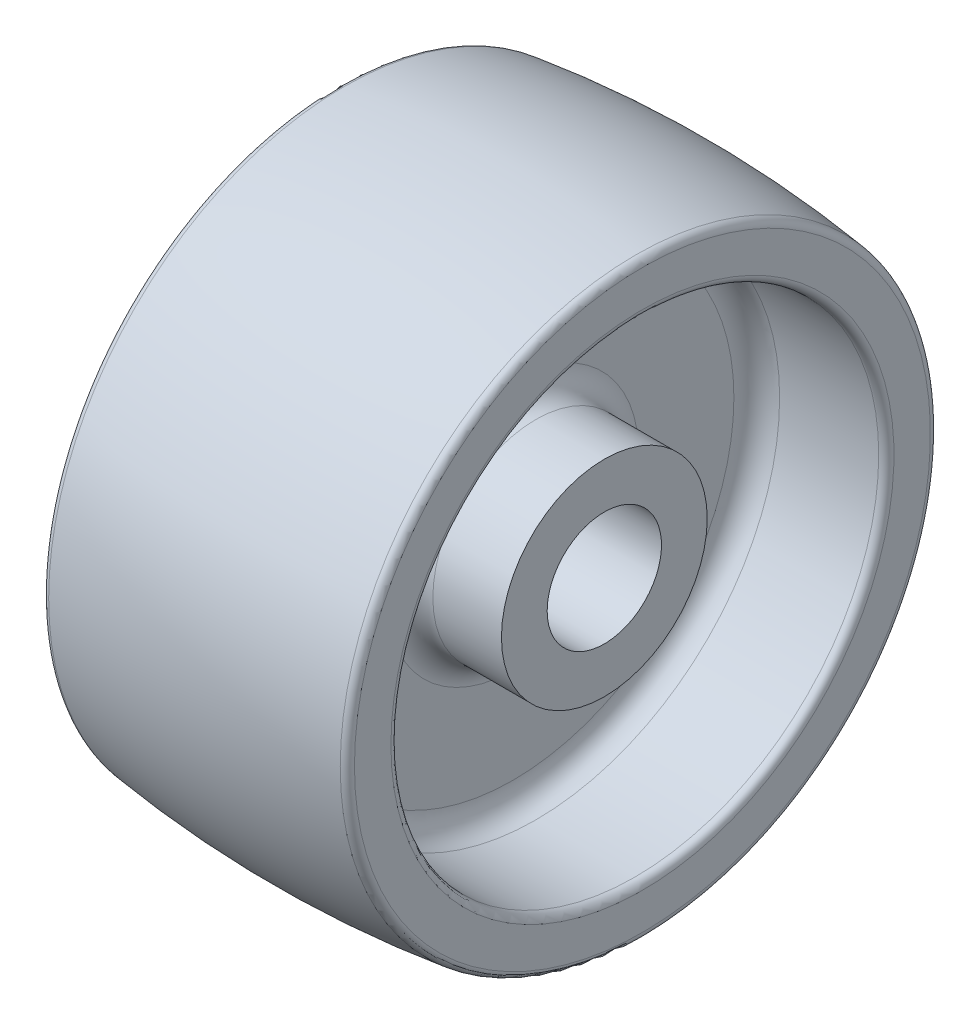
ISO-10303-21;
HEADER;
FILE_DESCRIPTION(('STEP AP214'),'2;1');
FILE_NAME('part.step','',(''),(''),'','','');
FILE_SCHEMA(('AUTOMOTIVE_DESIGN { 1 0 10303 214 1 1 1 1 }'));
ENDSEC;
DATA;
#1=APPLICATION_CONTEXT('core data for automotive mechanical design processes');
#2=APPLICATION_PROTOCOL_DEFINITION('international standard','automotive_design',2000,#1);
#3=PRODUCT_CONTEXT('',#1,'mechanical');
#4=PRODUCT('Part','Part','',(#3));
#5=PRODUCT_RELATED_PRODUCT_CATEGORY('part','',(#4));
#6=PRODUCT_DEFINITION_FORMATION('','',#4);
#7=PRODUCT_DEFINITION_CONTEXT('part definition',#1,'design');
#8=PRODUCT_DEFINITION('design','',#6,#7);
#9=PRODUCT_DEFINITION_SHAPE('','',#8);
#10=(LENGTH_UNIT() NAMED_UNIT(*) SI_UNIT(.MILLI.,.METRE.));
#11=(NAMED_UNIT(*) PLANE_ANGLE_UNIT() SI_UNIT($,.RADIAN.));
#12=(NAMED_UNIT(*) SI_UNIT($,.STERADIAN.) SOLID_ANGLE_UNIT());
#13=UNCERTAINTY_MEASURE_WITH_UNIT(LENGTH_MEASURE(1.E-05),#10,'distance_accuracy_value','');
#14=(GEOMETRIC_REPRESENTATION_CONTEXT(3) GLOBAL_UNCERTAINTY_ASSIGNED_CONTEXT((#13)) GLOBAL_UNIT_ASSIGNED_CONTEXT((#10,
#11,#12)) REPRESENTATION_CONTEXT('',''));
#15=CARTESIAN_POINT('',(0.,0.,0.));
#16=DIRECTION('',(0.,0.,1.));
#17=DIRECTION('',(1.,0.,0.));
#18=AXIS2_PLACEMENT_3D('',#15,#16,#17);
#19=CARTESIAN_POINT('',(40.,64.,0.));
#20=DIRECTION('',(-1.,0.,0.));
#21=DIRECTION('',(0.,0.,1.));
#22=AXIS2_PLACEMENT_3D('',#19,#20,#21);
#23=PLANE('',#22);
#24=CARTESIAN_POINT('',(40.0000000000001,0.,0.));
#25=DIRECTION('',(-1.,0.,0.));
#26=DIRECTION('',(0.,0.,1.));
#27=AXIS2_PLACEMENT_3D('',#24,#25,#26);
#28=CIRCLE('',#27,66.);
#29=CARTESIAN_POINT('',(40.0000000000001,0.,66.0000000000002));
#30=VERTEX_POINT('',#29);
#31=EDGE_CURVE('E59',#30,#30,#28,.T.);
#32=ORIENTED_EDGE('',*,*,#31,.T.);
#33=EDGE_LOOP('',(#32));
#34=FACE_BOUND('',#33,.T.);
#35=CARTESIAN_POINT('',(40.0000000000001,0.,0.));
#36=DIRECTION('',(-1.,0.,0.));
#37=DIRECTION('',(0.,0.,1.));
#38=AXIS2_PLACEMENT_3D('',#35,#36,#37);
#39=CIRCLE('',#38,75.5672512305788);
#40=CARTESIAN_POINT('',(40.0000000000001,0.,75.5672512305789));
#41=VERTEX_POINT('',#40);
#42=EDGE_CURVE('E62',#41,#41,#39,.F.);
#43=ORIENTED_EDGE('',*,*,#42,.T.);
#44=EDGE_LOOP('',(#43));
#45=FACE_BOUND('',#44,.T.);
#46=ADVANCED_FACE('F34',(#34,#45),#23,.F.);
#47=CARTESIAN_POINT('',(0.,0.,0.));
#48=DIRECTION('',(-1.,0.,0.));
#49=DIRECTION('',(0.,0.,1.));
#50=AXIS2_PLACEMENT_3D('',#47,#48,#49);
#51=DEGENERATE_TOROIDAL_SURFACE('',#50,220.,300.,.F.);
#52=CARTESIAN_POINT('',(38.2550335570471,0.,0.));
#53=DIRECTION('',(-1.,0.,0.));
#54=DIRECTION('',(0.,0.,1.));
#55=AXIS2_PLACEMENT_3D('',#52,#53,#54);
#56=CIRCLE('',#55,77.5509240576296);
#57=CARTESIAN_POINT('',(38.2550335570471,0.,77.5509240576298));
#58=VERTEX_POINT('',#57);
#59=EDGE_CURVE('E48',#58,#58,#56,.T.);
#60=ORIENTED_EDGE('',*,*,#59,.T.);
#61=EDGE_LOOP('',(#60));
#62=FACE_BOUND('',#61,.T.);
#63=CARTESIAN_POINT('',(-38.255033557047,-2.4980018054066E-13,0.));
#64=DIRECTION('',(1.,0.,0.));
#65=DIRECTION('',(0.,0.,-1.));
#66=AXIS2_PLACEMENT_3D('',#63,#64,#65);
#67=CIRCLE('',#66,77.5509240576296);
#68=CARTESIAN_POINT('',(-38.255033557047,-2.49783364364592E-13,-77.5509240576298));
#69=VERTEX_POINT('',#68);
#70=EDGE_CURVE('E53',#69,#69,#67,.T.);
#71=ORIENTED_EDGE('',*,*,#70,.T.);
#72=EDGE_LOOP('',(#71));
#73=FACE_BOUND('',#72,.T.);
#74=ADVANCED_FACE('F134',(#62,#73),#51,.F.);
#75=CARTESIAN_POINT('',(-40.,64.,0.));
#76=DIRECTION('',(1.,0.,0.));
#77=DIRECTION('',(0.,0.,-1.));
#78=AXIS2_PLACEMENT_3D('',#75,#76,#77);
#79=PLANE('',#78);
#80=CARTESIAN_POINT('',(-40.,-2.22044604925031E-13,0.));
#81=DIRECTION('',(1.,0.,0.));
#82=DIRECTION('',(0.,0.,-1.));
#83=AXIS2_PLACEMENT_3D('',#80,#81,#82);
#84=CIRCLE('',#83,66.);
#85=CARTESIAN_POINT('',(-40.,-2.22030293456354E-13,-66.0000000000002));
#86=VERTEX_POINT('',#85);
#87=EDGE_CURVE('E10',#86,#86,#84,.T.);
#88=ORIENTED_EDGE('',*,*,#87,.T.);
#89=EDGE_LOOP('',(#88));
#90=FACE_BOUND('',#89,.T.);
#91=CARTESIAN_POINT('',(-40.,-2.22044604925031E-13,0.));
#92=DIRECTION('',(1.,0.,0.));
#93=DIRECTION('',(0.,0.,-1.));
#94=AXIS2_PLACEMENT_3D('',#91,#92,#93);
#95=CIRCLE('',#94,75.5672512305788);
#96=CARTESIAN_POINT('',(-40.,-2.22028218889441E-13,-75.5672512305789));
#97=VERTEX_POINT('',#96);
#98=EDGE_CURVE('E40',#97,#97,#95,.F.);
#99=ORIENTED_EDGE('',*,*,#98,.T.);
#100=EDGE_LOOP('',(#99));
#101=FACE_BOUND('',#100,.T.);
#102=ADVANCED_FACE('F139',(#90,#101),#79,.F.);
#103=CARTESIAN_POINT('',(-44.4786429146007,-2.4980018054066E-13,0.));
#104=DIRECTION('',(-1.,0.,0.));
#105=DIRECTION('',(0.,0.,1.));
#106=AXIS2_PLACEMENT_3D('',#103,#104,#105);
#107=CYLINDRICAL_SURFACE('',#106,64.);
#108=CARTESIAN_POINT('',(-38.,-2.4980018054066E-13,0.));
#109=DIRECTION('',(1.,0.,0.));
#110=DIRECTION('',(0.,0.,-1.));
#111=AXIS2_PLACEMENT_3D('',#108,#109,#110);
#112=CIRCLE('',#111,64.);
#113=CARTESIAN_POINT('',(-38.,-2.49786302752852E-13,-64.0000000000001));
#114=VERTEX_POINT('',#113);
#115=EDGE_CURVE('E44',#114,#114,#112,.F.);
#116=ORIENTED_EDGE('',*,*,#115,.T.);
#117=EDGE_LOOP('',(#116));
#118=FACE_BOUND('',#117,.T.);
#119=CARTESIAN_POINT('',(-12.,0.,0.));
#120=DIRECTION('',(1.,0.,0.));
#121=DIRECTION('',(0.,0.,-1.));
#122=AXIS2_PLACEMENT_3D('',#119,#120,#121);
#123=CIRCLE('',#122,64.);
#124=CARTESIAN_POINT('',(-12.,0.,-64.0000000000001));
#125=VERTEX_POINT('',#124);
#126=EDGE_CURVE('E80',#125,#125,#123,.T.);
#127=ORIENTED_EDGE('',*,*,#126,.T.);
#128=EDGE_LOOP('',(#127));
#129=FACE_BOUND('',#128,.T.);
#130=ADVANCED_FACE('F130',(#118,#129),#107,.F.);
#131=CARTESIAN_POINT('',(-6.00000000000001,64.0000000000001,0.));
#132=DIRECTION('',(1.,0.,0.));
#133=DIRECTION('',(0.,0.,-1.));
#134=AXIS2_PLACEMENT_3D('',#131,#132,#133);
#135=PLANE('',#134);
#136=CARTESIAN_POINT('',(-6.00000000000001,0.,0.));
#137=DIRECTION('',(1.,0.,0.));
#138=DIRECTION('',(0.,0.,-1.));
#139=AXIS2_PLACEMENT_3D('',#136,#137,#138);
#140=CIRCLE('',#139,58.);
#141=CARTESIAN_POINT('',(-6.00000000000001,0.,-58.0000000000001));
#142=VERTEX_POINT('',#141);
#143=EDGE_CURVE('E83',#142,#142,#140,.F.);
#144=ORIENTED_EDGE('',*,*,#143,.T.);
#145=EDGE_LOOP('',(#144));
#146=FACE_BOUND('',#145,.T.);
#147=CARTESIAN_POINT('',(-6.00000000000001,0.,0.));
#148=DIRECTION('',(1.,0.,0.));
#149=DIRECTION('',(0.,0.,-1.));
#150=AXIS2_PLACEMENT_3D('',#147,#148,#149);
#151=CIRCLE('',#150,33.);
#152=CARTESIAN_POINT('',(-6.00000000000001,0.,-33.0000000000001));
#153=VERTEX_POINT('',#152);
#154=EDGE_CURVE('E86',#153,#153,#151,.T.);
#155=ORIENTED_EDGE('',*,*,#154,.T.);
#156=EDGE_LOOP('',(#155));
#157=FACE_BOUND('',#156,.T.);
#158=ADVANCED_FACE('F124',(#146,#157),#135,.F.);
#159=CARTESIAN_POINT('',(-44.4786429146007,-2.4980018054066E-13,0.));
#160=DIRECTION('',(-1.,0.,0.));
#161=DIRECTION('',(0.,0.,1.));
#162=AXIS2_PLACEMENT_3D('',#159,#160,#161);
#163=CYLINDRICAL_SURFACE('',#162,27.);
#164=CARTESIAN_POINT('',(-12.,0.,0.));
#165=DIRECTION('',(1.,0.,0.));
#166=DIRECTION('',(0.,0.,-1.));
#167=AXIS2_PLACEMENT_3D('',#164,#165,#166);
#168=CIRCLE('',#167,27.);
#169=CARTESIAN_POINT('',(-12.,0.,-27.0000000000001));
#170=VERTEX_POINT('',#169);
#171=EDGE_CURVE('E77',#170,#170,#168,.F.);
#172=ORIENTED_EDGE('',*,*,#171,.T.);
#173=EDGE_LOOP('',(#172));
#174=FACE_BOUND('',#173,.T.);
#175=CARTESIAN_POINT('',(-30.,0.,0.));
#176=DIRECTION('',(-1.,0.,0.));
#177=DIRECTION('',(0.,0.,1.));
#178=AXIS2_PLACEMENT_3D('',#175,#176,#177);
#179=CIRCLE('',#178,27.);
#180=CARTESIAN_POINT('',(-30.,0.,27.0000000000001));
#181=VERTEX_POINT('',#180);
#182=EDGE_CURVE('E89',#181,#181,#179,.T.);
#183=ORIENTED_EDGE('',*,*,#182,.F.);
#184=EDGE_LOOP('',(#183));
#185=FACE_BOUND('',#184,.T.);
#186=ADVANCED_FACE('F119',(#174,#185),#163,.T.);
#187=CARTESIAN_POINT('',(-29.9999999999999,27.,0.));
#188=DIRECTION('',(1.,0.,0.));
#189=DIRECTION('',(0.,0.,-1.));
#190=AXIS2_PLACEMENT_3D('',#187,#188,#189);
#191=PLANE('',#190);
#192=CARTESIAN_POINT('',(-30.,0.,0.));
#193=DIRECTION('',(-1.,0.,0.));
#194=DIRECTION('',(0.,0.,1.));
#195=AXIS2_PLACEMENT_3D('',#192,#193,#194);
#196=CIRCLE('',#195,15.);
#197=CARTESIAN_POINT('',(-30.,0.,15.));
#198=VERTEX_POINT('',#197);
#199=EDGE_CURVE('E92',#198,#198,#196,.T.);
#200=ORIENTED_EDGE('',*,*,#199,.F.);
#201=EDGE_LOOP('',(#200));
#202=FACE_BOUND('',#201,.T.);
#203=ORIENTED_EDGE('',*,*,#182,.T.);
#204=EDGE_LOOP('',(#203));
#205=FACE_BOUND('',#204,.T.);
#206=ADVANCED_FACE('F113',(#202,#205),#191,.F.);
#207=CARTESIAN_POINT('',(-44.4786429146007,-2.4980018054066E-13,0.));
#208=DIRECTION('',(-1.,0.,0.));
#209=DIRECTION('',(0.,0.,1.));
#210=AXIS2_PLACEMENT_3D('',#207,#208,#209);
#211=CYLINDRICAL_SURFACE('',#210,15.);
#212=CARTESIAN_POINT('',(30.0000000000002,-2.22044604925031E-13,0.));
#213=DIRECTION('',(-1.,0.,0.));
#214=DIRECTION('',(0.,0.,1.));
#215=AXIS2_PLACEMENT_3D('',#212,#213,#214);
#216=CIRCLE('',#215,15.);
#217=CARTESIAN_POINT('',(30.0000000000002,-2.22047857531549E-13,15.));
#218=VERTEX_POINT('',#217);
#219=EDGE_CURVE('E95',#218,#218,#216,.T.);
#220=ORIENTED_EDGE('',*,*,#219,.F.);
#221=EDGE_LOOP('',(#220));
#222=FACE_BOUND('',#221,.T.);
#223=ORIENTED_EDGE('',*,*,#199,.T.);
#224=EDGE_LOOP('',(#223));
#225=FACE_BOUND('',#224,.T.);
#226=ADVANCED_FACE('F107',(#222,#225),#211,.F.);
#227=CARTESIAN_POINT('',(30.,27.,0.));
#228=DIRECTION('',(-1.,0.,0.));
#229=DIRECTION('',(0.,0.,1.));
#230=AXIS2_PLACEMENT_3D('',#227,#228,#229);
#231=PLANE('',#230);
#232=CARTESIAN_POINT('',(30.0000000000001,-2.22044604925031E-13,0.));
#233=DIRECTION('',(-1.,0.,0.));
#234=DIRECTION('',(0.,0.,1.));
#235=AXIS2_PLACEMENT_3D('',#232,#233,#234);
#236=CIRCLE('',#235,27.);
#237=CARTESIAN_POINT('',(30.0000000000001,-2.22050459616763E-13,27.0000000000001));
#238=VERTEX_POINT('',#237);
#239=EDGE_CURVE('E98',#238,#238,#236,.T.);
#240=ORIENTED_EDGE('',*,*,#239,.F.);
#241=EDGE_LOOP('',(#240));
#242=FACE_BOUND('',#241,.T.);
#243=ORIENTED_EDGE('',*,*,#219,.T.);
#244=EDGE_LOOP('',(#243));
#245=FACE_BOUND('',#244,.T.);
#246=ADVANCED_FACE('F104',(#242,#245),#231,.F.);
#247=CARTESIAN_POINT('',(-44.4786429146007,-2.4980018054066E-13,0.));
#248=DIRECTION('',(-1.,0.,0.));
#249=DIRECTION('',(0.,0.,1.));
#250=AXIS2_PLACEMENT_3D('',#247,#248,#249);
#251=CYLINDRICAL_SURFACE('',#250,27.);
#252=CARTESIAN_POINT('',(12.0000000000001,0.,0.));
#253=DIRECTION('',(-1.,0.,0.));
#254=DIRECTION('',(0.,0.,1.));
#255=AXIS2_PLACEMENT_3D('',#252,#253,#254);
#256=CIRCLE('',#255,27.);
#257=CARTESIAN_POINT('',(12.0000000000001,0.,27.0000000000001));
#258=VERTEX_POINT('',#257);
#259=EDGE_CURVE('E68',#258,#258,#256,.F.);
#260=ORIENTED_EDGE('',*,*,#259,.T.);
#261=EDGE_LOOP('',(#260));
#262=FACE_BOUND('',#261,.T.);
#263=ORIENTED_EDGE('',*,*,#239,.T.);
#264=EDGE_LOOP('',(#263));
#265=FACE_BOUND('',#264,.T.);
#266=ADVANCED_FACE('F102',(#262,#265),#251,.T.);
#267=CARTESIAN_POINT('',(5.99999999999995,64.,0.));
#268=DIRECTION('',(-1.,0.,0.));
#269=DIRECTION('',(0.,0.,1.));
#270=AXIS2_PLACEMENT_3D('',#267,#268,#269);
#271=PLANE('',#270);
#272=CARTESIAN_POINT('',(6.00000000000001,0.,0.));
#273=DIRECTION('',(-1.,0.,0.));
#274=DIRECTION('',(0.,0.,1.));
#275=AXIS2_PLACEMENT_3D('',#272,#273,#274);
#276=CIRCLE('',#275,33.);
#277=CARTESIAN_POINT('',(6.00000000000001,0.,33.0000000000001));
#278=VERTEX_POINT('',#277);
#279=EDGE_CURVE('E71',#278,#278,#276,.T.);
#280=ORIENTED_EDGE('',*,*,#279,.T.);
#281=EDGE_LOOP('',(#280));
#282=FACE_BOUND('',#281,.T.);
#283=CARTESIAN_POINT('',(6.00000000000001,0.,0.));
#284=DIRECTION('',(-1.,0.,0.));
#285=DIRECTION('',(0.,0.,1.));
#286=AXIS2_PLACEMENT_3D('',#283,#284,#285);
#287=CIRCLE('',#286,58.);
#288=CARTESIAN_POINT('',(6.00000000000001,0.,58.0000000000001));
#289=VERTEX_POINT('',#288);
#290=EDGE_CURVE('E74',#289,#289,#287,.F.);
#291=ORIENTED_EDGE('',*,*,#290,.T.);
#292=EDGE_LOOP('',(#291));
#293=FACE_BOUND('',#292,.T.);
#294=ADVANCED_FACE('F187',(#282,#293),#271,.F.);
#295=CARTESIAN_POINT('',(-44.4786429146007,-2.4980018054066E-13,0.));
#296=DIRECTION('',(-1.,0.,0.));
#297=DIRECTION('',(0.,0.,1.));
#298=AXIS2_PLACEMENT_3D('',#295,#296,#297);
#299=CYLINDRICAL_SURFACE('',#298,64.);
#300=CARTESIAN_POINT('',(38.0000000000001,0.,0.));
#301=DIRECTION('',(-1.,0.,0.));
#302=DIRECTION('',(0.,0.,1.));
#303=AXIS2_PLACEMENT_3D('',#300,#301,#302);
#304=CIRCLE('',#303,64.);
#305=CARTESIAN_POINT('',(38.0000000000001,0.,64.0000000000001));
#306=VERTEX_POINT('',#305);
#307=EDGE_CURVE('E56',#306,#306,#304,.F.);
#308=ORIENTED_EDGE('',*,*,#307,.T.);
#309=EDGE_LOOP('',(#308));
#310=FACE_BOUND('',#309,.T.);
#311=CARTESIAN_POINT('',(12.0000000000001,0.,0.));
#312=DIRECTION('',(-1.,0.,0.));
#313=DIRECTION('',(0.,0.,1.));
#314=AXIS2_PLACEMENT_3D('',#311,#312,#313);
#315=CIRCLE('',#314,64.);
#316=CARTESIAN_POINT('',(12.0000000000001,0.,64.0000000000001));
#317=VERTEX_POINT('',#316);
#318=EDGE_CURVE('E65',#317,#317,#315,.T.);
#319=ORIENTED_EDGE('',*,*,#318,.T.);
#320=EDGE_LOOP('',(#319));
#321=FACE_BOUND('',#320,.T.);
#322=ADVANCED_FACE('F183',(#310,#321),#299,.F.);
#323=CARTESIAN_POINT('',(-12.,0.,0.));
#324=DIRECTION('',(1.,0.,0.));
#325=DIRECTION('',(0.,0.,-1.));
#326=AXIS2_PLACEMENT_3D('',#323,#324,#325);
#327=TOROIDAL_SURFACE('',#326,58.,6.);
#328=ORIENTED_EDGE('',*,*,#126,.F.);
#329=EDGE_LOOP('',(#328));
#330=FACE_BOUND('',#329,.T.);
#331=ORIENTED_EDGE('',*,*,#143,.F.);
#332=EDGE_LOOP('',(#331));
#333=FACE_BOUND('',#332,.T.);
#334=ADVANCED_FACE('F179',(#330,#333),#327,.F.);
#335=CARTESIAN_POINT('',(-12.,0.,0.));
#336=DIRECTION('',(1.,0.,0.));
#337=DIRECTION('',(0.,0.,-1.));
#338=AXIS2_PLACEMENT_3D('',#335,#336,#337);
#339=TOROIDAL_SURFACE('',#338,33.,6.);
#340=ORIENTED_EDGE('',*,*,#154,.F.);
#341=EDGE_LOOP('',(#340));
#342=FACE_BOUND('',#341,.T.);
#343=ORIENTED_EDGE('',*,*,#171,.F.);
#344=EDGE_LOOP('',(#343));
#345=FACE_BOUND('',#344,.T.);
#346=ADVANCED_FACE('F175',(#342,#345),#339,.F.);
#347=CARTESIAN_POINT('',(12.0000000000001,0.,0.));
#348=DIRECTION('',(-1.,0.,0.));
#349=DIRECTION('',(0.,0.,1.));
#350=AXIS2_PLACEMENT_3D('',#347,#348,#349);
#351=TOROIDAL_SURFACE('',#350,33.,6.);
#352=ORIENTED_EDGE('',*,*,#259,.F.);
#353=EDGE_LOOP('',(#352));
#354=FACE_BOUND('',#353,.T.);
#355=ORIENTED_EDGE('',*,*,#279,.F.);
#356=EDGE_LOOP('',(#355));
#357=FACE_BOUND('',#356,.T.);
#358=ADVANCED_FACE('F171',(#354,#357),#351,.F.);
#359=CARTESIAN_POINT('',(12.0000000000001,0.,0.));
#360=DIRECTION('',(-1.,0.,0.));
#361=DIRECTION('',(0.,0.,1.));
#362=AXIS2_PLACEMENT_3D('',#359,#360,#361);
#363=TOROIDAL_SURFACE('',#362,58.,6.);
#364=ORIENTED_EDGE('',*,*,#290,.F.);
#365=EDGE_LOOP('',(#364));
#366=FACE_BOUND('',#365,.T.);
#367=ORIENTED_EDGE('',*,*,#318,.F.);
#368=EDGE_LOOP('',(#367));
#369=FACE_BOUND('',#368,.T.);
#370=ADVANCED_FACE('F167',(#366,#369),#363,.F.);
#371=CARTESIAN_POINT('',(38.0000000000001,0.,0.));
#372=DIRECTION('',(-1.,0.,0.));
#373=DIRECTION('',(0.,0.,1.));
#374=AXIS2_PLACEMENT_3D('',#371,#372,#373);
#375=TOROIDAL_SURFACE('',#374,66.,2.);
#376=ORIENTED_EDGE('',*,*,#307,.F.);
#377=EDGE_LOOP('',(#376));
#378=FACE_BOUND('',#377,.T.);
#379=ORIENTED_EDGE('',*,*,#31,.F.);
#380=EDGE_LOOP('',(#379));
#381=FACE_BOUND('',#380,.T.);
#382=ADVANCED_FACE('F149',(#378,#381),#375,.T.);
#383=CARTESIAN_POINT('',(38.0000000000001,0.,0.));
#384=DIRECTION('',(-1.,0.,0.));
#385=DIRECTION('',(0.,0.,1.));
#386=AXIS2_PLACEMENT_3D('',#383,#384,#385);
#387=TOROIDAL_SURFACE('',#386,75.5672512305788,2.);
#388=ORIENTED_EDGE('',*,*,#42,.F.);
#389=EDGE_LOOP('',(#388));
#390=FACE_BOUND('',#389,.T.);
#391=ORIENTED_EDGE('',*,*,#59,.F.);
#392=EDGE_LOOP('',(#391));
#393=FACE_BOUND('',#392,.T.);
#394=ADVANCED_FACE('F145',(#390,#393),#387,.T.);
#395=CARTESIAN_POINT('',(-38.,-2.4980018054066E-13,0.));
#396=DIRECTION('',(1.,0.,0.));
#397=DIRECTION('',(0.,0.,-1.));
#398=AXIS2_PLACEMENT_3D('',#395,#396,#397);
#399=TOROIDAL_SURFACE('',#398,66.,2.);
#400=ORIENTED_EDGE('',*,*,#87,.F.);
#401=EDGE_LOOP('',(#400));
#402=FACE_BOUND('',#401,.T.);
#403=ORIENTED_EDGE('',*,*,#115,.F.);
#404=EDGE_LOOP('',(#403));
#405=FACE_BOUND('',#404,.T.);
#406=ADVANCED_FACE('F148',(#402,#405),#399,.T.);
#407=CARTESIAN_POINT('',(-38.,-2.4980018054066E-13,0.));
#408=DIRECTION('',(1.,0.,0.));
#409=DIRECTION('',(0.,0.,-1.));
#410=AXIS2_PLACEMENT_3D('',#407,#408,#409);
#411=TOROIDAL_SURFACE('',#410,75.5672512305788,2.);
#412=ORIENTED_EDGE('',*,*,#70,.F.);
#413=EDGE_LOOP('',(#412));
#414=FACE_BOUND('',#413,.T.);
#415=ORIENTED_EDGE('',*,*,#98,.F.);
#416=EDGE_LOOP('',(#415));
#417=FACE_BOUND('',#416,.T.);
#418=ADVANCED_FACE('F155',(#414,#417),#411,.T.);
#419=CLOSED_SHELL('',(#46,#74,#102,#130,#158,#186,#206,#226,#246,#266,#294,#322,#334,#346,#358,
#370,#382,#394,#406,#418));
#420=MANIFOLD_SOLID_BREP('B2',#419);
#421=ADVANCED_BREP_SHAPE_REPRESENTATION('',(#18,#420),#14);
#422=SHAPE_DEFINITION_REPRESENTATION(#9,#421);
ENDSEC;
END-ISO-10303-21;
